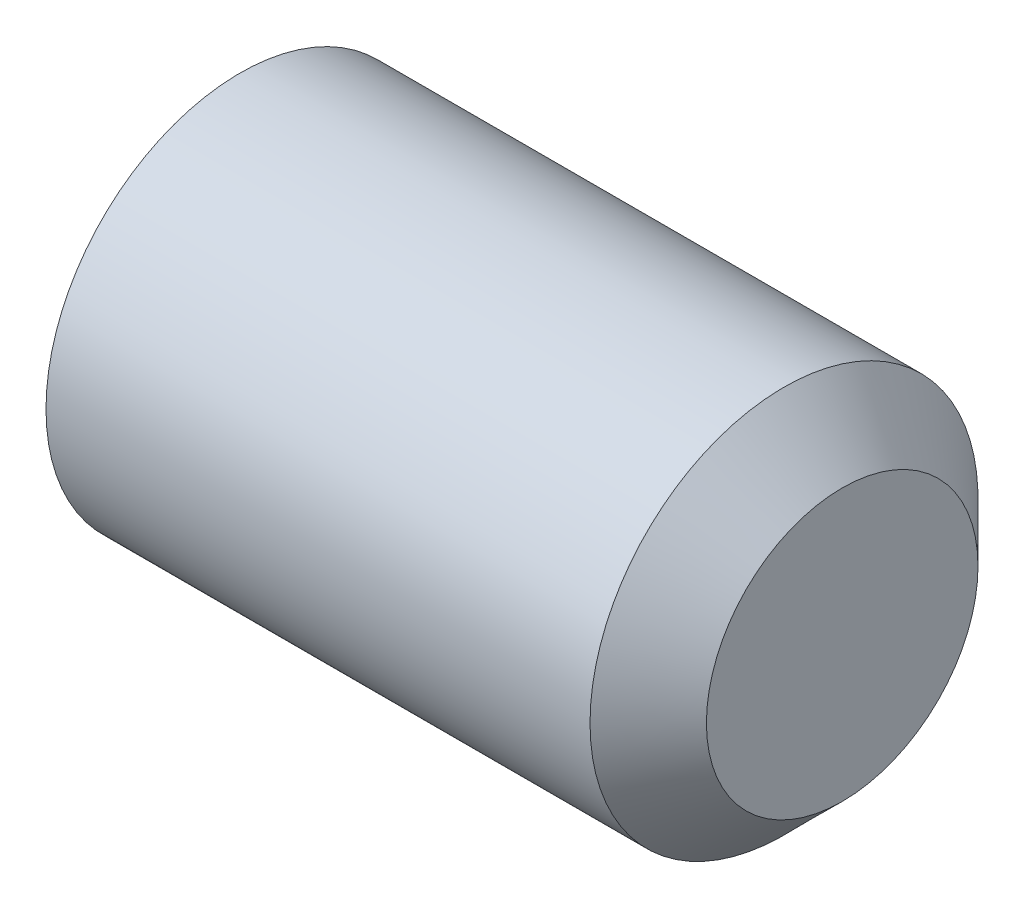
from build123d import *

# Parameters (mm, degrees)
HEX_2_DEPTH = 6


with BuildPart() as part:
    # BodySke → BaseBody (revolve)
    with BuildSketch(Plane.XY, mode=Mode.PRIVATE) as basebody_sk:
        Polygon((0, 0), (0, 4.172), (0.478046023, 5), (14.5, 5), (16, 3.5), (16, 0), align=None)
    revolve(basebody_sk.sketch.rotate(Axis((-12.7, 0, 0), (1, 0, 0)), 90), axis=Axis((-12.7, 0, 0), (1, 0, 0)))

    # Sketch2 → Hex 2 (cut)
    with BuildSketch(Plane.ZY):
        Polygon((1.443375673, 2.5), (-1.443375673, 2.5), (-2.886751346, 0), (-1.443375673, -2.5), (1.443375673, -2.5), (2.886751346, 0), align=None)
    extrude(amount=-HEX_2_DEPTH, mode=Mode.SUBTRACT)


solid = part.part
